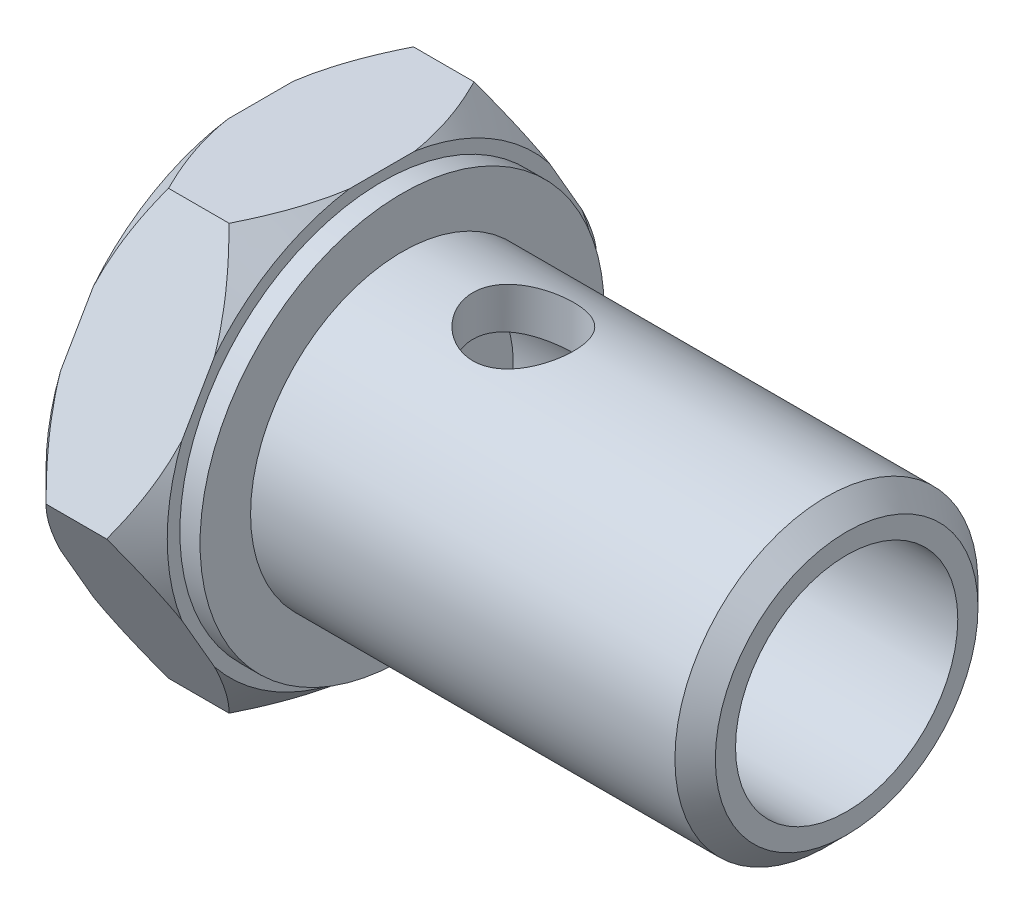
from build123d import *

# Parameters (mm, degrees)
SKETCH2_R               = 7.5
SKETCH2_R_2             = 5.5
BOSS_EXTRUDE1_DEPTH     = 22
CHAMFER1_SIZE           = 1
SKETCH3_R               = 10
BOSS_EXTRUDE2_DEPTH     = 1
BOSS_EXTRUDE3_DEPTH     = 6
CUT_EXTRUDE1_DEPTH      = 28.22590678
CUT_EXTRUDE1_DEPTH_BACK = 28.22590678
SKETCH6_R               = 2.5


with BuildPart() as part:
    # Sketch2 → Boss-Extrude1 (new body)
    with BuildSketch(Plane(origin=(0, 0, 0), x_dir=(0, 0, -1), z_dir=(1, 0, 0))):
        Circle(SKETCH2_R)
        Circle(SKETCH2_R_2, mode=Mode.SUBTRACT)
    extrude(amount=BOSS_EXTRUDE1_DEPTH)

    # Chamfer1
    chamfer1_edges = [part.edges().sort_by_distance(p)[0] for p in [
        (22, 0, 7.5),
    ]]
    chamfer(chamfer1_edges, length=CHAMFER1_SIZE)

    # Sketch3 → Boss-Extrude2 (add)
    with BuildSketch(Plane.ZY):
        Circle(SKETCH3_R)
    extrude(amount=BOSS_EXTRUDE2_DEPTH)

    # Sketch4 → Boss-Extrude3 (add)
    with BuildSketch(Plane.ZY.offset(1)):
        Polygon((12.124355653, 0), (6.062177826, 10.5), (-6.062177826, 10.5), (-12.124355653, 0), (-6.062177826, -10.5), (6.062177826, -10.5), align=None)
    extrude(amount=BOSS_EXTRUDE3_DEPTH)

    # Sketch5 → Cut-Revolve2 (revolve, cut)
    with BuildSketch(Plane(origin=(0, 0, 0), x_dir=(1, 0, 0), z_dir=(0, 1, 0)), mode=Mode.PRIVATE) as cut_revolve2_sk:
        Polygon((-7, 10.624355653), (-5.5, 12.124355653), (-7, 12.124355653), align=None)
        Polygon((-1, 12.124355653), (-1, 10.624355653), (-2.5, 12.124355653), align=None)
    revolve(cut_revolve2_sk.sketch.rotate(Axis((0, 0, 0), (-1, 0, 0)), 180), axis=Axis((0, 0, 0), (-1, 0, 0)), mode=Mode.SUBTRACT)

    # Sketch6 → Cut-Extrude1 (cut, two sides: drawn at the far end of the back side and taken through both)
    with BuildSketch(Plane(origin=(0, 0, 0), x_dir=(1, 0, 0), z_dir=(0, 1, 0)).offset(-CUT_EXTRUDE1_DEPTH_BACK)):
        with Locations(Location((6, 0, 0), (0, 0, 270))):
            Circle(SKETCH6_R)
    extrude(amount=CUT_EXTRUDE1_DEPTH + CUT_EXTRUDE1_DEPTH_BACK, mode=Mode.SUBTRACT)


solid = part.part
